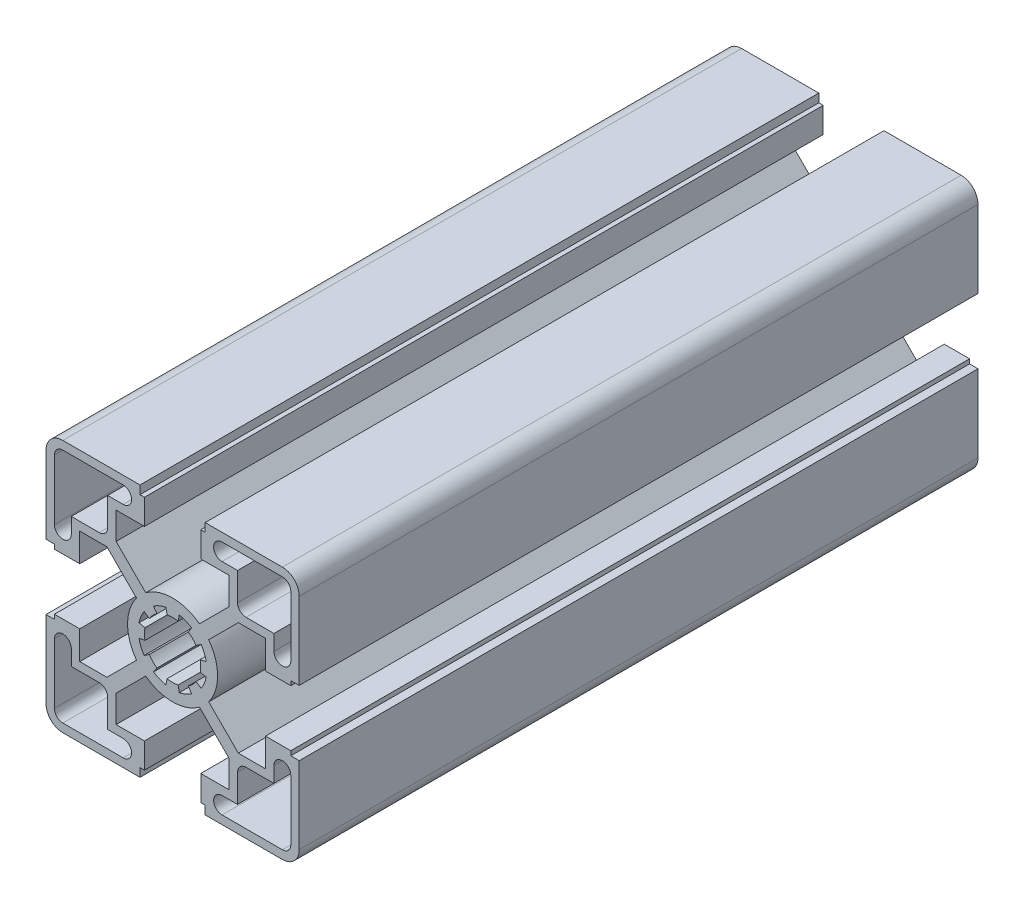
from build123d import *

# Parameters (mm, degrees)
BOSS_EXTRUDE1_DEPTH = 60.325


with BuildPart() as part:
    # Sketch1 → Boss-Extrude1 (new, symmetric)
    with BuildSketch(Plane.XY):
        with BuildLine():
            Line((-19.5072, 22.5044), (-5.7912, 22.5044))
            Line((-5.7912, 22.5044), (-5.7912, 21.0058))
            Line((-5.7912, 21.0058), (-5.0038, 21.0058))
            Line((-5.0038, 21.0058), (-5.0038, 16.51))
            Line((-5.0038, 16.51), (-10.0457, 16.51))
            Line((-10.0457, 16.51), (-10.0457, 11.680106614))
            Line((-10.0457, 11.680106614), (-4.781026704, 6.415433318))
            ThreePointArc((-4.781026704, 6.415433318), (0, 8.001), (4.781026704, 6.415433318))
            Line((4.781026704, 6.415433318), (10.0457, 11.680106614))
            Line((10.0457, 11.680106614), (10.0457, 16.51))
            Line((10.0457, 16.51), (5.0038, 16.51))
            Line((5.0038, 16.51), (5.0038, 21.0058))
            Line((5.0038, 21.0058), (5.7912, 21.0058))
            Line((5.7912, 21.0058), (5.7912, 22.5044))
            Line((5.7912, 22.5044), (19.5072, 22.5044))
            ThreePointArc((19.5072, 22.5044), (21.626540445, 21.626540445), (22.5044, 19.5072))
            Line((22.5044, 19.5072), (22.5044, 5.7912))
            Line((22.5044, 5.7912), (21.0058, 5.7912))
            Line((21.0058, 5.7912), (21.0058, 5.0038))
            Line((21.0058, 5.0038), (16.51, 5.0038))
            Line((16.51, 5.0038), (16.51, 10.0457))
            Line((16.51, 10.0457), (11.680106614, 10.0457))
            Line((11.680106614, 10.0457), (6.415433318, 4.781026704))
            ThreePointArc((6.415433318, 4.781026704), (8.001, 0), (6.415433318, -4.781026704))
            Line((6.415433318, -4.781026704), (11.680106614, -10.0457))
            Line((11.680106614, -10.0457), (16.51, -10.0457))
            Line((16.51, -10.0457), (16.51, -5.0038))
            Line((16.51, -5.0038), (21.0058, -5.0038))
            Line((21.0058, -5.0038), (21.0058, -5.7912))
            Line((21.0058, -5.7912), (22.5044, -5.7912))
            Line((22.5044, -5.7912), (22.5044, -19.5072))
            ThreePointArc((22.5044, -19.5072), (21.626540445, -21.626540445), (19.5072, -22.5044))
            Line((19.5072, -22.5044), (5.7912, -22.5044))
            Line((5.7912, -22.5044), (5.7912, -21.0058))
            Line((5.7912, -21.0058), (5.0038, -21.0058))
            Line((5.0038, -21.0058), (5.0038, -16.51))
            Line((5.0038, -16.51), (10.0457, -16.51))
            Line((10.0457, -16.51), (10.0457, -11.680106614))
            Line((10.0457, -11.680106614), (4.781026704, -6.415433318))
            ThreePointArc((4.781026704, -6.415433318), (0, -8.001), (-4.781026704, -6.415433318))
            Line((-4.781026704, -6.415433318), (-10.0457, -11.680106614))
            Line((-10.0457, -11.680106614), (-10.0457, -16.51))
            Line((-10.0457, -16.51), (-5.0038, -16.51))
            Line((-5.0038, -16.51), (-5.0038, -21.0058))
            Line((-5.0038, -21.0058), (-5.7912, -21.0058))
            Line((-5.7912, -21.0058), (-5.7912, -22.5044))
            Line((-5.7912, -22.5044), (-19.5072, -22.5044))
            ThreePointArc((-19.5072, -22.5044), (-21.626540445, -21.626540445), (-22.5044, -19.5072))
            Line((-22.5044, -19.5072), (-22.5044, -5.7912))
            Line((-22.5044, -5.7912), (-21.0058, -5.7912))
            Line((-21.0058, -5.7912), (-21.0058, -5.0038))
            Line((-21.0058, -5.0038), (-16.51, -5.0038))
            Line((-16.51, -5.0038), (-16.51, -10.0457))
            Line((-16.51, -10.0457), (-11.680106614, -10.0457))
            Line((-11.680106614, -10.0457), (-6.415433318, -4.781026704))
            ThreePointArc((-6.415433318, -4.781026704), (-8.001, 0), (-6.415433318, 4.781026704))
            Line((-6.415433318, 4.781026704), (-11.680106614, 10.0457))
            Line((-11.680106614, 10.0457), (-16.51, 10.0457))
            Line((-16.51, 10.0457), (-16.51, 5.0038))
            Line((-16.51, 5.0038), (-21.0058, 5.0038))
            Line((-21.0058, 5.0038), (-21.0058, 5.7912))
            Line((-21.0058, 5.7912), (-22.5044, 5.7912))
            Line((-22.5044, 5.7912), (-22.5044, 19.5072))
            ThreePointArc((-22.5044, 19.5072), (-21.626540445, 21.626540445), (-19.5072, 22.5044))
        make_face()
        with BuildLine():
            Line((-18.0086, 11.5443), (-13.0429, 11.5443))
            ThreePointArc((-13.0429, 11.5443), (-11.983229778, 11.983229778), (-11.5443, 13.0429))
            Line((-11.5443, 13.0429), (-11.5443, 18.0086))
            Line((-11.5443, 18.0086), (-8.7884, 18.0086))
            ThreePointArc((-8.7884, 18.0086), (-7.2898, 19.5072), (-8.7884, 21.0058))
            Line((-8.7884, 21.0058), (-19.5072, 21.0058))
            ThreePointArc((-19.5072, 21.0058), (-20.566870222, 20.566870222), (-21.0058, 19.5072))
            Line((-21.0058, 19.5072), (-21.0058, 8.7884))
            ThreePointArc((-21.0058, 8.7884), (-19.5072, 7.2898), (-18.0086, 8.7884))
            Line((-18.0086, 8.7884), (-18.0086, 11.5443))
        make_face(mode=Mode.SUBTRACT)
        with BuildLine():
            Line((1.189270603, 5.978867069), (0.976192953, 4.907653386))
            ThreePointArc((0.976192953, 4.907653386), (0, 5.0038), (-0.976192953, 4.907653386))
            Line((-0.976192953, 4.907653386), (-1.189270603, 5.978867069))
            ThreePointArc((-1.189270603, 5.978867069), (-2.332838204, 5.63196963), (-3.38675614, 5.068638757))
            Line((-3.38675614, 5.068638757), (-2.779962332, 4.160507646))
            ThreePointArc((-2.779962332, 4.160507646), (-3.538220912, 3.538220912), (-4.160507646, 2.779962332))
            Line((-4.160507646, 2.779962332), (-5.068638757, 3.38675614))
            ThreePointArc((-5.068638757, 3.38675614), (-5.63196963, 2.332838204), (-5.978867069, 1.189270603))
            Line((-5.978867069, 1.189270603), (-4.907653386, 0.976192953))
            ThreePointArc((-4.907653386, 0.976192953), (-5.0038, 0), (-4.907653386, -0.976192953))
            Line((-4.907653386, -0.976192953), (-5.978867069, -1.189270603))
            ThreePointArc((-5.978867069, -1.189270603), (-5.63196963, -2.332838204), (-5.068638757, -3.38675614))
            Line((-5.068638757, -3.38675614), (-4.160507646, -2.779962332))
            ThreePointArc((-4.160507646, -2.779962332), (-3.538220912, -3.538220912), (-2.779962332, -4.160507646))
            Line((-2.779962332, -4.160507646), (-3.38675614, -5.068638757))
            ThreePointArc((-3.38675614, -5.068638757), (-2.332838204, -5.63196963), (-1.189270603, -5.978867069))
            Line((-1.189270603, -5.978867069), (-0.976192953, -4.907653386))
            ThreePointArc((-0.976192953, -4.907653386), (0, -5.0038), (0.976192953, -4.907653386))
            Line((0.976192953, -4.907653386), (1.189270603, -5.978867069))
            ThreePointArc((1.189270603, -5.978867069), (2.332838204, -5.63196963), (3.38675614, -5.068638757))
            Line((3.38675614, -5.068638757), (2.779962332, -4.160507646))
            ThreePointArc((2.779962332, -4.160507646), (3.538220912, -3.538220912), (4.160507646, -2.779962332))
            Line((4.160507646, -2.779962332), (5.068638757, -3.38675614))
            ThreePointArc((5.068638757, -3.38675614), (5.63196963, -2.332838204), (5.978867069, -1.189270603))
            Line((5.978867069, -1.189270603), (4.907653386, -0.976192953))
            ThreePointArc((4.907653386, -0.976192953), (5.0038, 0), (4.907653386, 0.976192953))
            Line((4.907653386, 0.976192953), (5.978867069, 1.189270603))
            ThreePointArc((5.978867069, 1.189270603), (5.63196963, 2.332838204), (5.068638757, 3.38675614))
            Line((5.068638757, 3.38675614), (4.160507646, 2.779962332))
            ThreePointArc((4.160507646, 2.779962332), (3.538220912, 3.538220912), (2.779962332, 4.160507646))
            Line((2.779962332, 4.160507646), (3.38675614, 5.068638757))
            ThreePointArc((3.38675614, 5.068638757), (2.332838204, 5.63196963), (1.189270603, 5.978867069))
        make_face(mode=Mode.SUBTRACT)
        with BuildLine():
            Line((11.5443, 18.0086), (8.7884, 18.0086))
            ThreePointArc((8.7884, 18.0086), (7.2898, 19.5072), (8.7884, 21.0058))
            Line((8.7884, 21.0058), (19.5072, 21.0058))
            ThreePointArc((19.5072, 21.0058), (20.566870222, 20.566870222), (21.0058, 19.5072))
            Line((21.0058, 19.5072), (21.0058, 8.7884))
            ThreePointArc((21.0058, 8.7884), (19.5072, 7.2898), (18.0086, 8.7884))
            Line((18.0086, 8.7884), (18.0086, 11.5443))
            Line((18.0086, 11.5443), (13.0429, 11.5443))
            ThreePointArc((13.0429, 11.5443), (11.983229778, 11.983229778), (11.5443, 13.0429))
            Line((11.5443, 13.0429), (11.5443, 18.0086))
        make_face(mode=Mode.SUBTRACT)
        with BuildLine():
            Line((18.0086, -11.5443), (13.0429, -11.5443))
            ThreePointArc((13.0429, -11.5443), (11.983229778, -11.983229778), (11.5443, -13.0429))
            Line((11.5443, -13.0429), (11.5443, -18.0086))
            Line((11.5443, -18.0086), (8.7884, -18.0086))
            ThreePointArc((8.7884, -18.0086), (7.2898, -19.5072), (8.7884, -21.0058))
            Line((8.7884, -21.0058), (19.5072, -21.0058))
            ThreePointArc((19.5072, -21.0058), (20.566870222, -20.566870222), (21.0058, -19.5072))
            Line((21.0058, -19.5072), (21.0058, -8.7884))
            ThreePointArc((21.0058, -8.7884), (19.5072, -7.2898), (18.0086, -8.7884))
            Line((18.0086, -8.7884), (18.0086, -11.5443))
        make_face(mode=Mode.SUBTRACT)
        with BuildLine():
            Line((-11.5443, -18.0086), (-8.7884, -18.0086))
            ThreePointArc((-8.7884, -18.0086), (-7.2898, -19.5072), (-8.7884, -21.0058))
            Line((-8.7884, -21.0058), (-19.5072, -21.0058))
            ThreePointArc((-19.5072, -21.0058), (-20.566870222, -20.566870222), (-21.0058, -19.5072))
            Line((-21.0058, -19.5072), (-21.0058, -8.7884))
            ThreePointArc((-21.0058, -8.7884), (-19.5072, -7.2898), (-18.0086, -8.7884))
            Line((-18.0086, -8.7884), (-18.0086, -11.5443))
            Line((-18.0086, -11.5443), (-13.0429, -11.5443))
            ThreePointArc((-13.0429, -11.5443), (-11.983229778, -11.983229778), (-11.5443, -13.0429))
            Line((-11.5443, -13.0429), (-11.5443, -18.0086))
        make_face(mode=Mode.SUBTRACT)
    extrude(amount=BOSS_EXTRUDE1_DEPTH, both=True)


solid = part.part
